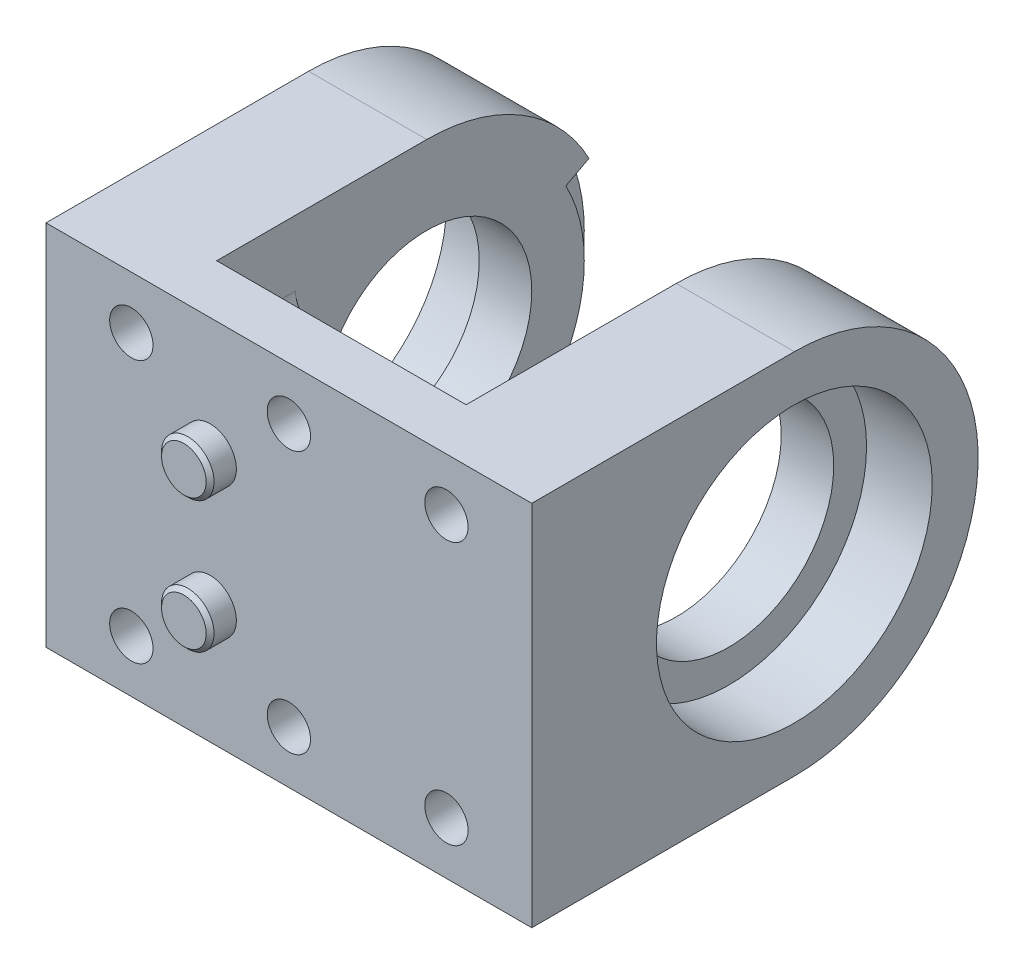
from build123d import *

# Parameters (mm, degrees)
SKETCH_1_W             = 37
SKETCH_1_H             = 28
SKETCH_1_R             = 1
EXTRUDE_1_DEPTH        = 4
SKETCH_2_R             = 2
EXTRUDE_2_DEPTH        = 2
SKETCH_3_R             = 8
EXTRUDE_3_DEPTH        = 9
SKETCH_4_R             = 10.5
CUT_EXTRUDE_1_DEPTH    = 5
SKETCH_5_W             = 19
SKETCH_5_H             = 4
EXTRUDE_4_DEPTH        = 6
FILLET_1_R             = 2
HOLE_WIZARD_M4_1_D     = 3.3
HOLE_WIZARD_M4_1_DEPTH = 9.1
HOLE_WIZARD_M4_1_TIP   = 0.991420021
CUT_EXTRUDE_2_DEPTH    = 2
CHAMFER_1_SIZE         = 0.3


with BuildPart() as part:
    # Sketch 1 → Extrude 1 (new body)
    with BuildSketch(Plane.XY):
        Rectangle(SKETCH_1_W, SKETCH_1_H)
        with Locations((0, 10)):
            Circle(SKETCH_1_R, mode=Mode.SUBTRACT)
        with Locations((12, 10)):
            Circle(SKETCH_1_R, mode=Mode.SUBTRACT)
        with Locations((-12, 10)):
            Circle(SKETCH_1_R, mode=Mode.SUBTRACT)
        with Locations(Location((0, -10, 0), (0, 0, 180))):
            Circle(SKETCH_1_R, mode=Mode.SUBTRACT)
        with Locations(Location((-12, -10, 0), (0, 0, 180))):
            Circle(SKETCH_1_R, mode=Mode.SUBTRACT)
        with Locations(Location((12, -10, 0), (0, 0, 180))):
            Circle(SKETCH_1_R, mode=Mode.SUBTRACT)
    extrude(amount=EXTRUDE_1_DEPTH)

    # Sketch 2 → Extrude 2 (add)
    with BuildSketch(Plane.XY.offset(4)):
        with Locations(Location((-6, 5, 0), (0, 0, 180))):
            Circle(SKETCH_2_R)
        with Locations(Location((-6, -5, 0), (0, 0, 180))):
            Circle(SKETCH_2_R)
    extrude(amount=EXTRUDE_2_DEPTH)

    # Sketch 3 → Extrude 3 (add)
    with BuildSketch(Plane(origin=(18.5, 0, 0), x_dir=(0, 0, -1), z_dir=(1, 0, 0))):
        with BuildLine():
            Line((0, 14), (0, -14))
            Line((0, -14), (16, -14))
            ThreePointArc((16, -14), (30, 0), (16, 14))
            Line((16, 14), (0, 14))
        make_face()
        with Locations((16, 0)):
            Circle(SKETCH_3_R, mode=Mode.SUBTRACT)
    extrude_3 = extrude(amount=-EXTRUDE_3_DEPTH)

    # Sketch 4 → Cut-Extrude 1 (cut)
    with BuildSketch(Plane(origin=(18.5, 0, 0), x_dir=(0, 0, -1), z_dir=(1, 0, 0))):
        with Locations((16, 0)):
            Circle(SKETCH_4_R)
    cut_extrude_1 = extrude(amount=-CUT_EXTRUDE_1_DEPTH, mode=Mode.SUBTRACT)

    # Mirror 1: Extrude 3, Cut-Extrude 1 across plane
    add(extrude_3.mirror(Plane(origin=(0, 0, 0), x_dir=(0, 0, 1), z_dir=(1, 0, 0))))
    add(cut_extrude_1.mirror(Plane(origin=(0, 0, 0), x_dir=(0, 0, 1), z_dir=(1, 0, 0))), mode=Mode.SUBTRACT)

    # Sketch 5 → Extrude 4 (add)
    with BuildSketch(Plane(origin=(0, 0, 0), x_dir=(-1, 0, 0), z_dir=(0, 0, -1))):
        with Locations((0, 5)):
            Rectangle(SKETCH_5_W, SKETCH_5_H)
        with Locations((0, -5)):
            Rectangle(SKETCH_5_W, SKETCH_5_H)
    extrude(amount=EXTRUDE_4_DEPTH)

    # Fillet 1
    fillet_1_edges = [part.edges().sort_by_distance(p)[0] for p in [
        (-9.5, 3, -3),
        (-9.5, 7, -3),
        (9.5, -7, -3),
        (-9.5, -7, -3),
        (-9.5, -3, -3),
        (9.5, -3, -3),
        (9.5, 7, -3),
        (9.5, 3, -3),
    ]]
    fillet(fillet_1_edges, radius=FILLET_1_R)

    # Hole Wizard M4 _1
    with Locations(Plane(origin=(12, -10, 4), x_dir=(1, 0, 0), z_dir=(0, 0, 1))):
        with Locations((0, 0), (-12, 0), (-24, 0), (-24, 20), (-12, 20), (0, 20)):
            Hole(HOLE_WIZARD_M4_1_D / 2, depth=HOLE_WIZARD_M4_1_DEPTH)
            with Locations((0, 0, -(HOLE_WIZARD_M4_1_DEPTH + HOLE_WIZARD_M4_1_TIP / 2))):  # 118° drill point
                Cone(0, HOLE_WIZARD_M4_1_D / 2, HOLE_WIZARD_M4_1_TIP, mode=Mode.SUBTRACT)

    # Sketch 7 → Cut-Extrude 2 (cut)
    with BuildSketch(Plane(origin=(-9.5, 0, 0), x_dir=(0, 0, -1), z_dir=(1, 0, 0))):
        with BuildLine():
            Line((26.595371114, 5.633658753), (28.3612663, 6.572601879))
            ThreePointArc((28.3612663, 6.572601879), (30, 0), (28.3612663, -6.572601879))
            Line((28.3612663, -6.572601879), (26.595371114, -5.633658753))
            ThreePointArc((26.595371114, -5.633658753), (28, 0), (26.595371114, 5.633658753))
        make_face()
    extrude(amount=-CUT_EXTRUDE_2_DEPTH, mode=Mode.SUBTRACT)

    # Chamfer 1
    chamfer_1_edges = [part.edges().sort_by_distance(p)[0] for p in [
        (-4, 5, 6),
        (-4, -5, 6),
    ]]
    chamfer(chamfer_1_edges, length=CHAMFER_1_SIZE)


solid = part.part
